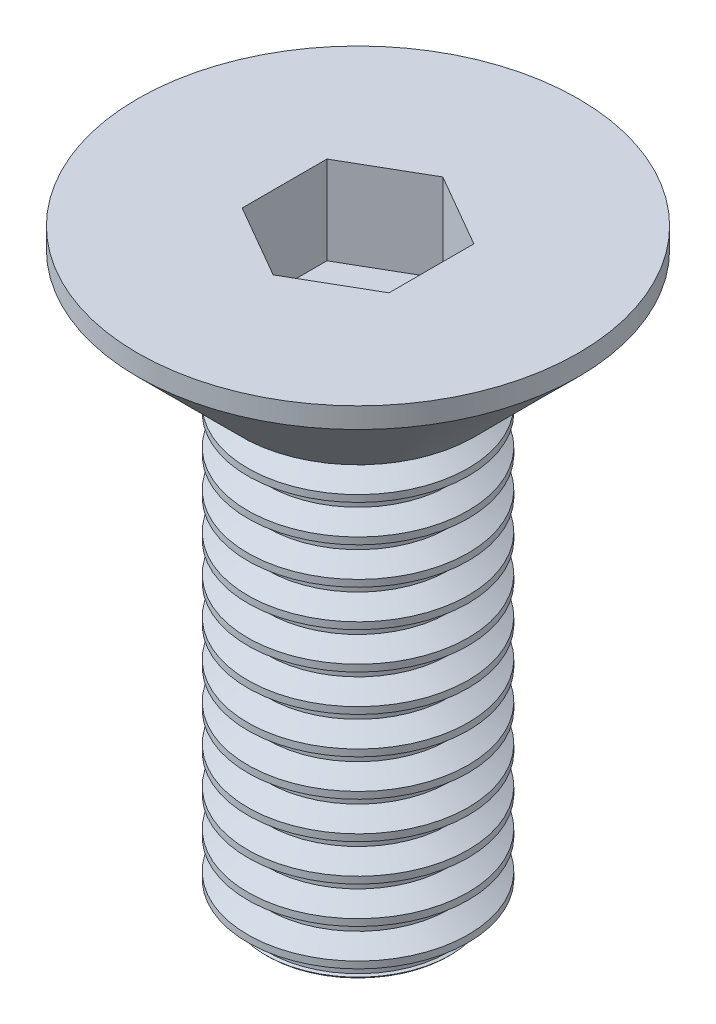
from build123d import *

# Parameters (mm, degrees)
GRIP_DEPTH          = 1.2
THREAD_SIMPLE_COUNT = 13
THREAD_SIMPLE_PITCH = 0.5


with BuildPart() as part:
    # Sketch2 → Body (revolve)
    with BuildSketch(Plane.XY):
        Polygon((0, -8), (1.226987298, -8), (1.5, -7.726987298), (1.5, -1.7), (1.58, -1.7), (3, -0.28), (3, 0), (0, 0), align=None)
    revolve(axis=Axis((0, 0, 0), (0, -1, 0)))

    # Sketch7 → Grip (cut)
    with BuildSketch(Plane(origin=(0, 0, 0), x_dir=(1, 0, 0), z_dir=(0, 1, 0))):
        Polygon((1, -0.577350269), (1, 0.577350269), (0, 1.154700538), (-1, 0.577350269), (-1, -0.577350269), (0, -1.154700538), align=None)
    extrude(amount=-GRIP_DEPTH, mode=Mode.SUBTRACT)

    # Sketch3 → Thread-Single (revolve, cut)
    with BuildSketch(Plane.XY):
        Polygon((1.5, -1.7), (1.226987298, -1.857623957), (1.226987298, -1.95), (1.5, -2.107623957), align=None)
    thread_single = revolve(axis=Axis((0, -8, 0), (0, 1, 0)), mode=Mode.SUBTRACT)

    # Thread-Simple: Thread-Single ×13
    with Locations(*[(0, -i * THREAD_SIMPLE_PITCH, 0) for i in range(1, THREAD_SIMPLE_COUNT)]):
        add(thread_single, mode=Mode.SUBTRACT)


solid = part.part
